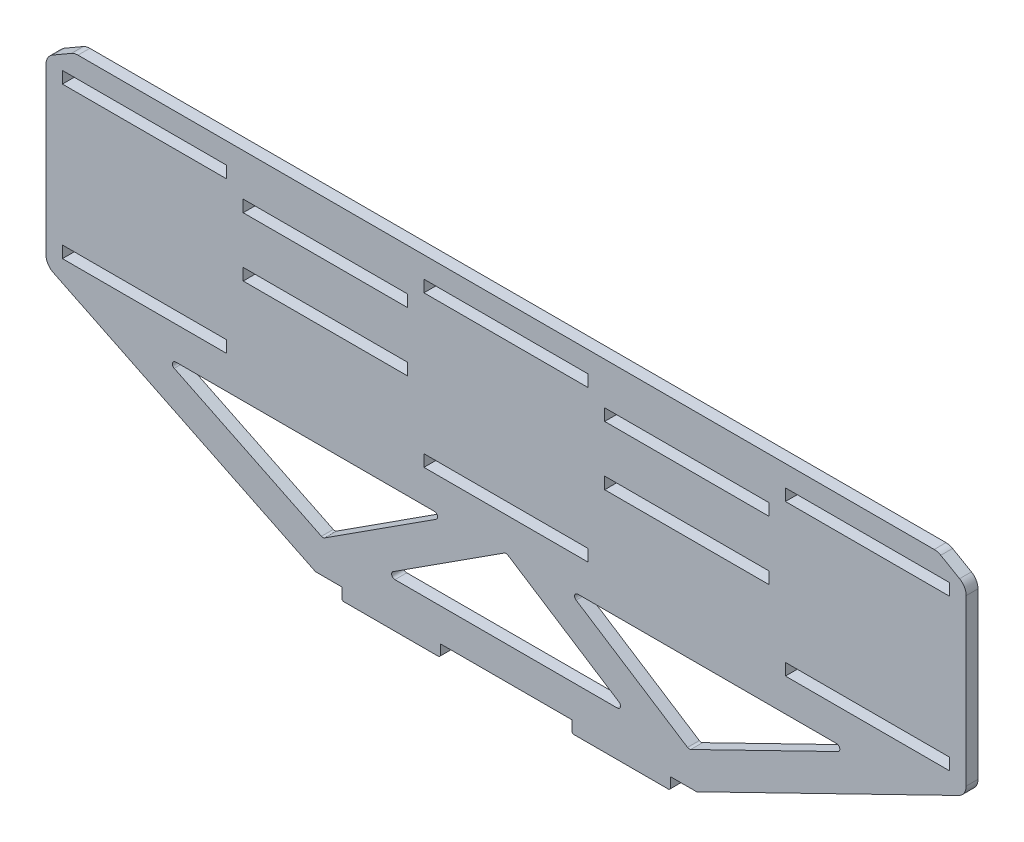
from build123d import *
from OCP.BRepFilletAPI import BRepFilletAPI_MakeChamfer

# Parameters (mm, degrees)
CROQUIS1_W              = 1400
CROQUIS1_H              = 500
SALIENTE_EXTRUIR1_DEPTH = 18
CROQUIS2_W              = 250
CROQUIS2_H              = 18
CORTAR_EXTRUIR1_DEPTH   = 1487.715843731
CHAFL_N1_SIZE           = 200
CHAFL_N1_SIZE2          = 410.060768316
CROQUIS4_W              = 150
CROQUIS4_H              = 18
SALIENTE_EXTRUIR2_DEPTH = 18
CORTAR_EXTRUIR3_DEPTH   = 1487.715843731
CHAFL_N2_SIZE           = 25
CHAFL_N2_SIZE2          = 43.301270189
CROQUIS6_W              = 250
CROQUIS6_H              = 18
CORTAR_EXTRUIR4_DEPTH   = 1487.715843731
REDONDEO1_R             = 20
REDONDEO2_R             = 5
CHAFL_N3_SIZE           = 2


with BuildPart() as part:
    # Croquis1 → Saliente-Extruir1 (new body)
    with BuildSketch(Plane.XY):
        with Locations((700, 250)):
            Rectangle(CROQUIS1_W, CROQUIS1_H)
    extrude(amount=SALIENTE_EXTRUIR1_DEPTH)

    # Croquis2 → Cortar-Extruir1 (cut, through all)
    with BuildSketch(Plane.XY.offset(18)):
        with Locations((150, 229)):
            Rectangle(CROQUIS2_W, CROQUIS2_H)
        with Locations((700, 229)):
            Rectangle(CROQUIS2_W, CROQUIS2_H)
        with Locations((1250, 229)):
            Rectangle(CROQUIS2_W, CROQUIS2_H)
        with Locations((1250, 459)):
            Rectangle(CROQUIS2_W, CROQUIS2_H)
        with Locations((700, 459)):
            Rectangle(CROQUIS2_W, CROQUIS2_H)
        with Locations((150, 459)):
            Rectangle(CROQUIS2_W, CROQUIS2_H)
    extrude(amount=-CORTAR_EXTRUIR1_DEPTH, mode=Mode.SUBTRACT)

    # Chafl_n1: one chamfer whose edges measure the first distance from different faces: ONE call of the kernel's chamfer builder (chamfer() names one face for all edges)
    chafl_n1_edges_1 = [part.edges().sort_by_distance(p)[0] for p in [
        (1400, 0, 9),
    ]]
    chafl_n1_side_1 = [part.faces().sort_by_distance(p)[0] for p in [
        (1400, 250, 9),
    ]]
    chafl_n1_edges_2 = [part.edges().sort_by_distance(p)[0] for p in [
        (0, 0, 9),
    ]]
    chafl_n1_side_2 = [part.faces().sort_by_distance(p)[0] for p in [
        (0, 250, 9),
    ]]
    chafl_n1 = BRepFilletAPI_MakeChamfer(part.part.solid().wrapped)
    for e in chafl_n1_edges_1:
        chafl_n1.Add(CHAFL_N1_SIZE, CHAFL_N1_SIZE2, e.wrapped, chafl_n1_side_1[0].wrapped)  # the first distance lies on this face
    for e in chafl_n1_edges_2:
        chafl_n1.Add(CHAFL_N1_SIZE, CHAFL_N1_SIZE2, e.wrapped, chafl_n1_side_2[0].wrapped)  # the first distance lies on this face
    add(Compound.cast(chafl_n1.Shape()), mode=Mode.REPLACE)

    # Croquis4 → Saliente-Extruir2 (add)
    with BuildSketch(Plane.XZ):
        with Locations((525, 9)):
            Rectangle(CROQUIS4_W, CROQUIS4_H)
        with Locations((875, 9)):
            Rectangle(CROQUIS4_W, CROQUIS4_H)
    extrude(amount=SALIENTE_EXTRUIR2_DEPTH)

    # Croquis5 → Cortar-Extruir3 (cut, through all)
    with BuildSketch(Plane.XY.offset(18)):
        Polygon((175.567716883, 170), (421.604177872, 50), (607.727488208, 170), align=None)
        Polygon((700, 170), (513.876689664, 50), (886.123310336, 50), align=None)
        Polygon((792.272511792, 170), (1224.432283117, 170), (978.395822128, 50), align=None)
    extrude(amount=-CORTAR_EXTRUIR3_DEPTH, mode=Mode.SUBTRACT)

    # Chafl_n2: one chamfer whose edges measure the first distance from different faces: ONE call of the kernel's chamfer builder (chamfer() names one face for all edges)
    chafl_n2_edges_1 = [part.edges().sort_by_distance(p)[0] for p in [
        (0, 500, 9),
    ]]
    chafl_n2_side_1 = [part.faces().sort_by_distance(p)[0] for p in [
        (0, 350, 9),
    ]]
    chafl_n2_edges_2 = [part.edges().sort_by_distance(p)[0] for p in [
        (1400, 500, 9),
    ]]
    chafl_n2_side_2 = [part.faces().sort_by_distance(p)[0] for p in [
        (1400, 350, 9),
    ]]
    chafl_n2 = BRepFilletAPI_MakeChamfer(part.part.solid().wrapped)
    for e in chafl_n2_edges_1:
        chafl_n2.Add(CHAFL_N2_SIZE, CHAFL_N2_SIZE2, e.wrapped, chafl_n2_side_1[0].wrapped)  # the first distance lies on this face
    for e in chafl_n2_edges_2:
        chafl_n2.Add(CHAFL_N2_SIZE, CHAFL_N2_SIZE2, e.wrapped, chafl_n2_side_2[0].wrapped)  # the first distance lies on this face
    add(Compound.cast(chafl_n2.Shape()), mode=Mode.REPLACE)

    # Croquis6 → Cortar-Extruir4 (cut, through all)
    with BuildSketch(Plane.XY.offset(18)):
        with Locations((425, 337)):
            Rectangle(CROQUIS6_W, CROQUIS6_H)
        with Locations((975, 337)):
            Rectangle(CROQUIS6_W, CROQUIS6_H)
        with Locations((425, 427)):
            Rectangle(CROQUIS6_W, CROQUIS6_H)
        with Locations((975, 427)):
            Rectangle(CROQUIS6_W, CROQUIS6_H)
    extrude(amount=-CORTAR_EXTRUIR4_DEPTH, mode=Mode.SUBTRACT)

    # Redondeo1
    redondeo1_edges = [part.edges().sort_by_distance(p)[0] for p in [
        (1400, 200, 9),
        (0, 200, 9),
        (43.301270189, 500, 9),
        (1356.698729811, 500, 9),
        (1400, 475, 9),
        (0, 475, 9),
    ]]
    fillet(redondeo1_edges, radius=REDONDEO1_R)

    # Redondeo2
    redondeo2_edges = [part.edges().sort_by_distance(p)[0] for p in [
        (700, 170, 9),
        (886.123310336, 50, 9),
        (513.876689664, 50, 9),
        (978.395822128, 50, 9),
        (792.272511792, 170, 9),
        (1224.432283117, 170, 9),
        (175.567716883, 170, 9),
        (607.727488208, 170, 9),
        (421.604177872, 50, 9),
    ]]
    fillet(redondeo2_edges, radius=REDONDEO2_R)

    # Chafl_n3
    chafl_n3_edges = [part.edges().sort_by_distance(p)[0] for p in [
        (450, -18, 9),
        (600, -18, 9),
        (950, -18, 9),
        (800, -18, 9),
    ]]
    chamfer(chafl_n3_edges, length=CHAFL_N3_SIZE)


solid = part.part
